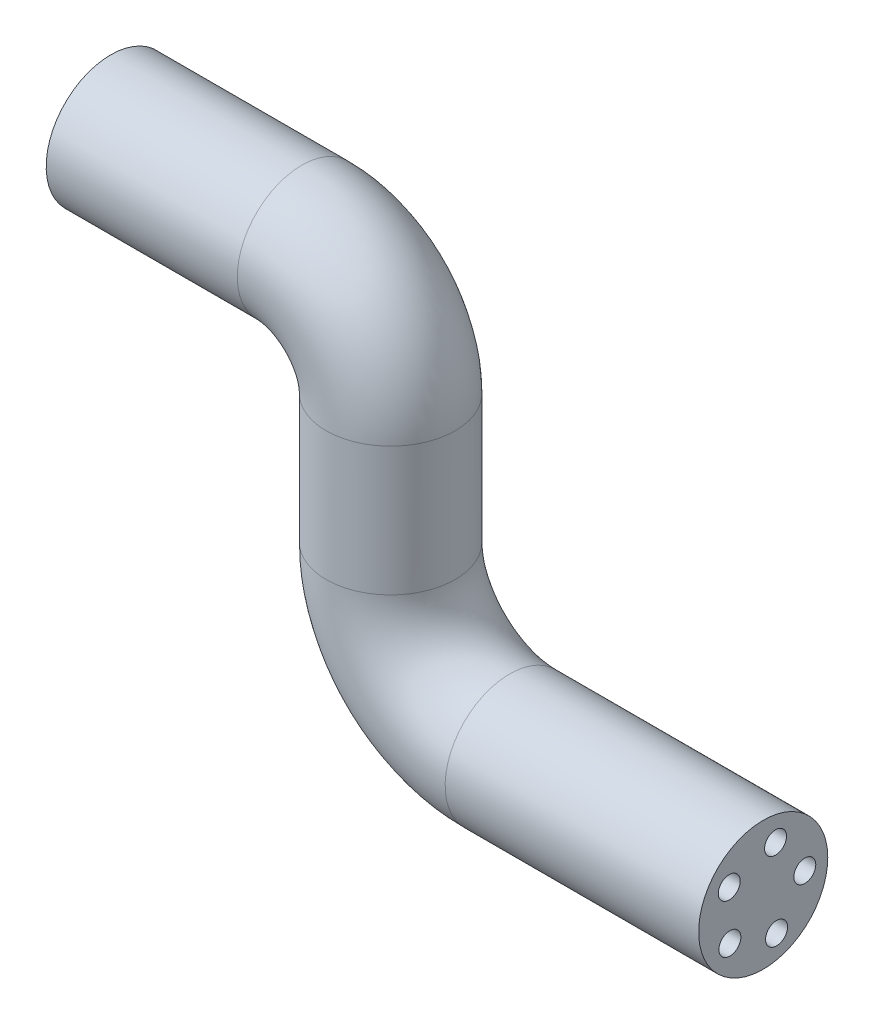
from build123d import *

# Parameters (mm, degrees)
SKETCH2_R   = 27.096902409
SKETCH2_R_2 = 4.608245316


with BuildPart() as part:
    # Sweep1: sweep along a path in Sketch1
    with BuildLine(Plane.XY) as sweep1_path:
        Line((0, 0), (80.216523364, 0))
        ThreePointArc((80.216523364, 0), (106.421046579, -10.854268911), (117.27531549, -37.058792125))
        Line((117.27531549, -37.058792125), (117.27531549, -91.13530649))
        ThreePointArc((117.27531549, -91.13530649), (131.973765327, -126.620503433), (167.458962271, -141.318953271))
        Line((167.458962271, -141.318953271), (273.864224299, -141.318953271))
    # Sketch2 → Sweep1 (sweep)
    with BuildSketch(Plane(origin=(273.864224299, -141.318953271, 0), x_dir=(0, 0, -1), z_dir=(1, 0, 0))):
        with Locations((0, 0.21953314)):
            Circle(SKETCH2_R)
        with Locations((17.456101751, 0.21953314)):
            Circle(SKETCH2_R_2, mode=Mode.SUBTRACT)
        with Locations((5.60302052, -16.533899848)):
            Circle(SKETCH2_R_2, mode=Mode.SUBTRACT)
        with Locations((-13.99324463, -10.438045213)):
            Circle(SKETCH2_R_2, mode=Mode.SUBTRACT)
        with Locations((-14.251321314, 10.082833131)):
            Circle(SKETCH2_R_2, mode=Mode.SUBTRACT)
        with Locations((5.185443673, 16.66957879)):
            Circle(SKETCH2_R_2, mode=Mode.SUBTRACT)
    sweep(path=sweep1_path.line)


solid = part.part
